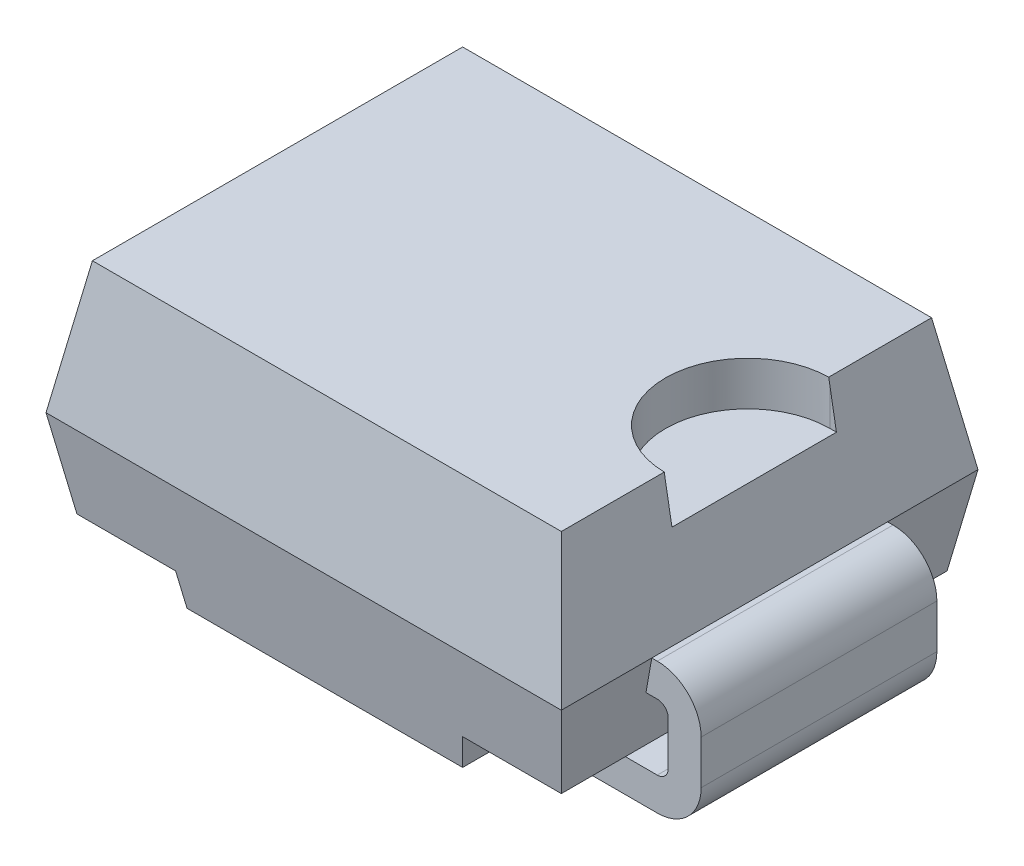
ISO-10303-21;
HEADER;
FILE_DESCRIPTION(('STEP AP214'),'2;1');
FILE_NAME('part.step','',(''),(''),'','','');
FILE_SCHEMA(('AUTOMOTIVE_DESIGN { 1 0 10303 214 1 1 1 1 }'));
ENDSEC;
DATA;
#1=APPLICATION_CONTEXT('core data for automotive mechanical design processes');
#2=APPLICATION_PROTOCOL_DEFINITION('international standard','automotive_design',2000,#1);
#3=PRODUCT_CONTEXT('',#1,'mechanical');
#4=PRODUCT('Part','Part','',(#3));
#5=PRODUCT_RELATED_PRODUCT_CATEGORY('part','',(#4));
#6=PRODUCT_DEFINITION_FORMATION('','',#4);
#7=PRODUCT_DEFINITION_CONTEXT('part definition',#1,'design');
#8=PRODUCT_DEFINITION('design','',#6,#7);
#9=PRODUCT_DEFINITION_SHAPE('','',#8);
#10=(LENGTH_UNIT() NAMED_UNIT(*) SI_UNIT(.MILLI.,.METRE.));
#11=(NAMED_UNIT(*) PLANE_ANGLE_UNIT() SI_UNIT($,.RADIAN.));
#12=(NAMED_UNIT(*) SI_UNIT($,.STERADIAN.) SOLID_ANGLE_UNIT());
#13=UNCERTAINTY_MEASURE_WITH_UNIT(LENGTH_MEASURE(1.E-05),#10,'distance_accuracy_value','');
#14=(GEOMETRIC_REPRESENTATION_CONTEXT(3) GLOBAL_UNCERTAINTY_ASSIGNED_CONTEXT((#13)) GLOBAL_UNIT_ASSIGNED_CONTEXT((#10,
#11,#12)) REPRESENTATION_CONTEXT('',''));
#15=CARTESIAN_POINT('',(0.,0.,0.));
#16=DIRECTION('',(0.,0.,1.));
#17=DIRECTION('',(1.,0.,0.));
#18=AXIS2_PLACEMENT_3D('',#15,#16,#17);
#19=CARTESIAN_POINT('',(-2.35,1.2,1.9));
#20=DIRECTION('',(0.984807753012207,0.173648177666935,0.));
#21=DIRECTION('',(-0.173648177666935,0.984807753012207,0.));
#22=AXIS2_PLACEMENT_3D('',#19,#20,#21);
#23=PLANE('',#22);
#24=DIRECTION('',(-0.17108786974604,0.970287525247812,-0.171087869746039));
#25=VECTOR('',#24,1.);
#26=CARTESIAN_POINT('',(-2.2387699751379,0.569183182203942,-1.7887699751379));
#27=LINE('',#26,#25);
#28=CARTESIAN_POINT('',(-2.20893841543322,0.4,-1.75893841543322));
#29=VERTEX_POINT('',#28);
#30=CARTESIAN_POINT('',(-2.35,1.2,-1.9));
#31=VERTEX_POINT('',#30);
#32=EDGE_CURVE('E330',#29,#31,#27,.T.);
#33=ORIENTED_EDGE('',*,*,#32,.F.);
#34=DIRECTION('',(0.,0.,-1.));
#35=VECTOR('',#34,1.);
#36=CARTESIAN_POINT('',(-2.20893841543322,0.4,1.9));
#37=LINE('',#36,#35);
#38=CARTESIAN_POINT('',(-2.20893841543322,0.4,1.75893841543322));
#39=VERTEX_POINT('',#38);
#40=EDGE_CURVE('E376',#39,#29,#37,.T.);
#41=ORIENTED_EDGE('',*,*,#40,.F.);
#42=DIRECTION('',(0.17108786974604,-0.970287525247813,-0.171087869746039));
#43=VECTOR('',#42,1.);
#44=CARTESIAN_POINT('',(-2.35,1.2,1.9));
#45=LINE('',#44,#43);
#46=CARTESIAN_POINT('',(-2.35,1.2,1.9));
#47=VERTEX_POINT('',#46);
#48=EDGE_CURVE('E347',#47,#39,#45,.T.);
#49=ORIENTED_EDGE('',*,*,#48,.F.);
#50=DIRECTION('',(0.,0.,-1.));
#51=VECTOR('',#50,1.);
#52=CARTESIAN_POINT('',(-2.35,1.2,1.9));
#53=LINE('',#52,#51);
#54=CARTESIAN_POINT('',(-2.35,1.2,1.075));
#55=VERTEX_POINT('',#54);
#56=EDGE_CURVE('E380',#47,#55,#53,.T.);
#57=ORIENTED_EDGE('',*,*,#56,.T.);
#58=DIRECTION('',(0.173648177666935,-0.984807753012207,0.));
#59=VECTOR('',#58,1.);
#60=CARTESIAN_POINT('',(-2.21469962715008,0.432673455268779,1.075));
#61=LINE('',#60,#59);
#62=CARTESIAN_POINT('',(-2.29710190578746,0.9,1.075));
#63=VERTEX_POINT('',#62);
#64=EDGE_CURVE('E390',#55,#63,#61,.T.);
#65=ORIENTED_EDGE('',*,*,#64,.T.);
#66=DIRECTION('',(0.,0.,-1.));
#67=VECTOR('',#66,1.);
#68=CARTESIAN_POINT('',(-2.29710190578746,0.9,1.075));
#69=LINE('',#68,#67);
#70=CARTESIAN_POINT('',(-2.29710190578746,0.9,-1.075));
#71=VERTEX_POINT('',#70);
#72=EDGE_CURVE('E388',#63,#71,#69,.T.);
#73=ORIENTED_EDGE('',*,*,#72,.T.);
#74=DIRECTION('',(0.173648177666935,-0.984807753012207,0.));
#75=VECTOR('',#74,1.);
#76=CARTESIAN_POINT('',(-2.21469962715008,0.432673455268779,-1.075));
#77=LINE('',#76,#75);
#78=CARTESIAN_POINT('',(-2.35,1.2,-1.075));
#79=VERTEX_POINT('',#78);
#80=EDGE_CURVE('E545',#79,#71,#77,.T.);
#81=ORIENTED_EDGE('',*,*,#80,.F.);
#82=EDGE_CURVE('E379',#79,#31,#53,.T.);
#83=ORIENTED_EDGE('',*,*,#82,.T.);
#84=EDGE_LOOP('',(#33,#41,#49,#57,#65,#73,#81,#83));
#85=FACE_BOUND('',#84,.T.);
#86=ADVANCED_FACE('F31',(#85),#23,.F.);
#87=CARTESIAN_POINT('',(2.35,1.2,1.9));
#88=DIRECTION('',(-0.984807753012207,0.173648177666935,0.));
#89=DIRECTION('',(-0.173648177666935,-0.984807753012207,0.));
#90=AXIS2_PLACEMENT_3D('',#87,#88,#89);
#91=PLANE('',#90);
#92=DIRECTION('',(-0.17108786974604,-0.970287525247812,0.171087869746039));
#93=VECTOR('',#92,1.);
#94=CARTESIAN_POINT('',(2.2387699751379,0.569183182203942,-1.7887699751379));
#95=LINE('',#94,#93);
#96=CARTESIAN_POINT('',(2.35,1.2,-1.9));
#97=VERTEX_POINT('',#96);
#98=CARTESIAN_POINT('',(2.20893841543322,0.4,-1.75893841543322));
#99=VERTEX_POINT('',#98);
#100=EDGE_CURVE('E328',#97,#99,#95,.T.);
#101=ORIENTED_EDGE('',*,*,#100,.F.);
#102=DIRECTION('',(0.,0.,-1.));
#103=VECTOR('',#102,1.);
#104=CARTESIAN_POINT('',(2.35,1.2,1.9));
#105=LINE('',#104,#103);
#106=CARTESIAN_POINT('',(2.35,1.2,-1.075));
#107=VERTEX_POINT('',#106);
#108=EDGE_CURVE('E356',#107,#97,#105,.T.);
#109=ORIENTED_EDGE('',*,*,#108,.F.);
#110=DIRECTION('',(0.173648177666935,0.984807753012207,0.));
#111=VECTOR('',#110,1.);
#112=CARTESIAN_POINT('',(2.06996191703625,-0.388174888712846,-1.075));
#113=LINE('',#112,#111);
#114=CARTESIAN_POINT('',(2.29710190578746,0.9,-1.075));
#115=VERTEX_POINT('',#114);
#116=EDGE_CURVE('E542',#115,#107,#113,.T.);
#117=ORIENTED_EDGE('',*,*,#116,.F.);
#118=DIRECTION('',(0.,0.,1.));
#119=VECTOR('',#118,1.);
#120=CARTESIAN_POINT('',(2.29710190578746,0.9,1.075));
#121=LINE('',#120,#119);
#122=CARTESIAN_POINT('',(2.29710190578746,0.9,1.075));
#123=VERTEX_POINT('',#122);
#124=EDGE_CURVE('E383',#115,#123,#121,.T.);
#125=ORIENTED_EDGE('',*,*,#124,.T.);
#126=DIRECTION('',(0.173648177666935,0.984807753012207,0.));
#127=VECTOR('',#126,1.);
#128=CARTESIAN_POINT('',(2.06996191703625,-0.388174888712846,1.075));
#129=LINE('',#128,#127);
#130=CARTESIAN_POINT('',(2.35,1.2,1.075));
#131=VERTEX_POINT('',#130);
#132=EDGE_CURVE('E386',#123,#131,#129,.T.);
#133=ORIENTED_EDGE('',*,*,#132,.T.);
#134=CARTESIAN_POINT('',(2.35,1.2,1.9));
#135=VERTEX_POINT('',#134);
#136=EDGE_CURVE('E357',#135,#131,#105,.T.);
#137=ORIENTED_EDGE('',*,*,#136,.F.);
#138=DIRECTION('',(0.17108786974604,0.970287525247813,0.171087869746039));
#139=VECTOR('',#138,1.);
#140=CARTESIAN_POINT('',(2.35,1.2,1.9));
#141=LINE('',#140,#139);
#142=CARTESIAN_POINT('',(2.20893841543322,0.4,1.75893841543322));
#143=VERTEX_POINT('',#142);
#144=EDGE_CURVE('E345',#143,#135,#141,.T.);
#145=ORIENTED_EDGE('',*,*,#144,.F.);
#146=DIRECTION('',(0.,0.,-1.));
#147=VECTOR('',#146,1.);
#148=CARTESIAN_POINT('',(2.20893841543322,0.4,1.9));
#149=LINE('',#148,#147);
#150=EDGE_CURVE('E360',#143,#99,#149,.T.);
#151=ORIENTED_EDGE('',*,*,#150,.T.);
#152=EDGE_LOOP('',(#101,#109,#117,#125,#133,#137,#145,#151));
#153=FACE_BOUND('',#152,.T.);
#154=ADVANCED_FACE('F641',(#153),#91,.F.);
#155=CARTESIAN_POINT('',(-2.13840762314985,2.4,1.9));
#156=DIRECTION('',(0.984807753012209,-0.173648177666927,0.));
#157=DIRECTION('',(0.173648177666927,0.984807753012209,0.));
#158=AXIS2_PLACEMENT_3D('',#155,#156,#157);
#159=PLANE('',#158);
#160=DIRECTION('',(-0.171087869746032,-0.970287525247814,0.17108786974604));
#161=VECTOR('',#160,1.);
#162=CARTESIAN_POINT('',(-2.14460115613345,2.36487472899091,1.69460115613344));
#163=LINE('',#162,#161);
#164=CARTESIAN_POINT('',(-2.13840762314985,2.4,1.68840762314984));
#165=VERTEX_POINT('',#164);
#166=EDGE_CURVE('E333',#165,#47,#163,.T.);
#167=ORIENTED_EDGE('',*,*,#166,.F.);
#168=DIRECTION('',(0.,0.,-1.));
#169=VECTOR('',#168,1.);
#170=CARTESIAN_POINT('',(-2.13840762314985,2.4,1.9));
#171=LINE('',#170,#169);
#172=CARTESIAN_POINT('',(-2.13840762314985,2.4,-1.68840762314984));
#173=VERTEX_POINT('',#172);
#174=EDGE_CURVE('E349',#165,#173,#171,.T.);
#175=ORIENTED_EDGE('',*,*,#174,.T.);
#176=DIRECTION('',(0.171087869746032,0.970287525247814,0.17108786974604));
#177=VECTOR('',#176,1.);
#178=CARTESIAN_POINT('',(-2.03337113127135,2.99569154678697,-1.58337113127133));
#179=LINE('',#178,#177);
#180=EDGE_CURVE('E316',#31,#173,#179,.T.);
#181=ORIENTED_EDGE('',*,*,#180,.F.);
#182=ORIENTED_EDGE('',*,*,#82,.F.);
#183=EDGE_CURVE('E384',#55,#79,#53,.T.);
#184=ORIENTED_EDGE('',*,*,#183,.F.);
#185=ORIENTED_EDGE('',*,*,#56,.F.);
#186=EDGE_LOOP('',(#167,#175,#181,#182,#184,#185));
#187=FACE_BOUND('',#186,.T.);
#188=ADVANCED_FACE('F567',(#187),#159,.F.);
#189=CARTESIAN_POINT('',(-2.20893841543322,0.4,1.9));
#190=DIRECTION('',(0.,1.,0.));
#191=DIRECTION('',(-1.,0.,0.));
#192=AXIS2_PLACEMENT_3D('',#189,#190,#191);
#193=PLANE('',#192);
#194=DIRECTION('',(-1.,0.,0.));
#195=VECTOR('',#194,1.);
#196=CARTESIAN_POINT('',(-2.20893841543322,0.4,-1.75893841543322));
#197=LINE('',#196,#195);
#198=CARTESIAN_POINT('',(-1.30893841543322,0.399999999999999,-1.75893841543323));
#199=VERTEX_POINT('',#198);
#200=EDGE_CURVE('E326',#199,#29,#197,.T.);
#201=ORIENTED_EDGE('',*,*,#200,.F.);
#202=DIRECTION('',(0.,0.,-1.));
#203=VECTOR('',#202,1.);
#204=CARTESIAN_POINT('',(-1.30893841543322,0.4,1.9));
#205=LINE('',#204,#203);
#206=CARTESIAN_POINT('',(-1.30893841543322,0.4,1.75893841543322));
#207=VERTEX_POINT('',#206);
#208=EDGE_CURVE('E373',#207,#199,#205,.T.);
#209=ORIENTED_EDGE('',*,*,#208,.F.);
#210=DIRECTION('',(1.,0.,0.));
#211=VECTOR('',#210,1.);
#212=CARTESIAN_POINT('',(-2.20893841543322,0.4,1.75893841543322));
#213=LINE('',#212,#211);
#214=EDGE_CURVE('E343',#39,#207,#213,.T.);
#215=ORIENTED_EDGE('',*,*,#214,.F.);
#216=ORIENTED_EDGE('',*,*,#40,.T.);
#217=EDGE_LOOP('',(#201,#209,#215,#216));
#218=FACE_BOUND('',#217,.T.);
#219=ADVANCED_FACE('F650',(#218),#193,.F.);
#220=CARTESIAN_POINT('',(-1.30893841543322,0.4,1.9));
#221=DIRECTION('',(0.984807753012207,0.173648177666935,0.));
#222=DIRECTION('',(-0.173648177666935,0.984807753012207,0.));
#223=AXIS2_PLACEMENT_3D('',#220,#221,#222);
#224=PLANE('',#223);
#225=DIRECTION('',(-0.17108786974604,0.970287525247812,-0.171087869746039));
#226=VECTOR('',#225,1.);
#227=CARTESIAN_POINT('',(-1.20183741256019,-0.207399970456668,-1.65183741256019));
#228=LINE('',#227,#226);
#229=CARTESIAN_POINT('',(-1.25684396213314,0.104557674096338,-1.70684396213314));
#230=VERTEX_POINT('',#229);
#231=EDGE_CURVE('E324',#230,#199,#228,.T.);
#232=ORIENTED_EDGE('',*,*,#231,.F.);
#233=DIRECTION('',(0.,0.,-1.));
#234=VECTOR('',#233,1.);
#235=CARTESIAN_POINT('',(-1.25684396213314,0.104557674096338,1.9));
#236=LINE('',#235,#234);
#237=CARTESIAN_POINT('',(-1.25684396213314,0.104557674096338,1.70684396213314));
#238=VERTEX_POINT('',#237);
#239=EDGE_CURVE('E370',#238,#230,#236,.T.);
#240=ORIENTED_EDGE('',*,*,#239,.F.);
#241=DIRECTION('',(0.17108786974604,-0.970287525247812,-0.171087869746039));
#242=VECTOR('',#241,1.);
#243=CARTESIAN_POINT('',(-1.31306743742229,0.42341684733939,1.76306743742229));
#244=LINE('',#243,#242);
#245=EDGE_CURVE('E341',#207,#238,#244,.T.);
#246=ORIENTED_EDGE('',*,*,#245,.F.);
#247=ORIENTED_EDGE('',*,*,#208,.T.);
#248=EDGE_LOOP('',(#232,#240,#246,#247));
#249=FACE_BOUND('',#248,.T.);
#250=ADVANCED_FACE('F718',(#249),#224,.F.);
#251=CARTESIAN_POINT('',(-1.25684396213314,0.104557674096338,1.9));
#252=DIRECTION('',(0.,1.,0.));
#253=DIRECTION('',(0.,0.,1.));
#254=AXIS2_PLACEMENT_3D('',#251,#252,#253);
#255=PLANE('',#254);
#256=DIRECTION('',(-1.,0.,0.));
#257=VECTOR('',#256,1.);
#258=CARTESIAN_POINT('',(-1.25684396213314,0.104557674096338,-1.70684396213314));
#259=LINE('',#258,#257);
#260=CARTESIAN_POINT('',(1.25684396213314,0.104557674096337,-1.70684396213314));
#261=VERTEX_POINT('',#260);
#262=EDGE_CURVE('E322',#261,#230,#259,.T.);
#263=ORIENTED_EDGE('',*,*,#262,.F.);
#264=DIRECTION('',(0.,0.,-1.));
#265=VECTOR('',#264,1.);
#266=CARTESIAN_POINT('',(1.25684396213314,0.104557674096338,1.9));
#267=LINE('',#266,#265);
#268=CARTESIAN_POINT('',(1.25684396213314,0.104557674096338,1.70684396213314));
#269=VERTEX_POINT('',#268);
#270=EDGE_CURVE('E367',#269,#261,#267,.T.);
#271=ORIENTED_EDGE('',*,*,#270,.F.);
#272=DIRECTION('',(1.,0.,0.));
#273=VECTOR('',#272,1.);
#274=CARTESIAN_POINT('',(-1.25684396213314,0.104557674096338,1.70684396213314));
#275=LINE('',#274,#273);
#276=EDGE_CURVE('E339',#238,#269,#275,.T.);
#277=ORIENTED_EDGE('',*,*,#276,.F.);
#278=ORIENTED_EDGE('',*,*,#239,.T.);
#279=EDGE_LOOP('',(#263,#271,#277,#278));
#280=FACE_BOUND('',#279,.T.);
#281=ADVANCED_FACE('F713',(#280),#255,.F.);
#282=CARTESIAN_POINT('',(1.30893841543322,0.4,1.9));
#283=DIRECTION('',(-0.984807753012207,0.173648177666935,0.));
#284=DIRECTION('',(-0.173648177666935,-0.984807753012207,0.));
#285=AXIS2_PLACEMENT_3D('',#282,#283,#284);
#286=PLANE('',#285);
#287=DIRECTION('',(-0.17108786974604,-0.970287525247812,0.171087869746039));
#288=VECTOR('',#287,1.);
#289=CARTESIAN_POINT('',(1.20183741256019,-0.207399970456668,-1.65183741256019));
#290=LINE('',#289,#288);
#291=CARTESIAN_POINT('',(1.30893841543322,0.4,-1.75893841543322));
#292=VERTEX_POINT('',#291);
#293=EDGE_CURVE('E320',#292,#261,#290,.T.);
#294=ORIENTED_EDGE('',*,*,#293,.F.);
#295=DIRECTION('',(0.,0.,-1.));
#296=VECTOR('',#295,1.);
#297=CARTESIAN_POINT('',(1.30893841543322,0.4,1.9));
#298=LINE('',#297,#296);
#299=CARTESIAN_POINT('',(1.30893841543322,0.4,1.75893841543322));
#300=VERTEX_POINT('',#299);
#301=EDGE_CURVE('E364',#300,#292,#298,.T.);
#302=ORIENTED_EDGE('',*,*,#301,.F.);
#303=DIRECTION('',(0.17108786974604,0.970287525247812,0.171087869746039));
#304=VECTOR('',#303,1.);
#305=CARTESIAN_POINT('',(1.31306743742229,0.42341684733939,1.76306743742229));
#306=LINE('',#305,#304);
#307=EDGE_CURVE('E337',#269,#300,#306,.T.);
#308=ORIENTED_EDGE('',*,*,#307,.F.);
#309=ORIENTED_EDGE('',*,*,#270,.T.);
#310=EDGE_LOOP('',(#294,#302,#308,#309));
#311=FACE_BOUND('',#310,.T.);
#312=ADVANCED_FACE('F708',(#311),#286,.F.);
#313=CARTESIAN_POINT('',(2.20893841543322,0.4,1.9));
#314=DIRECTION('',(0.,1.,0.));
#315=DIRECTION('',(-1.,0.,0.));
#316=AXIS2_PLACEMENT_3D('',#313,#314,#315);
#317=PLANE('',#316);
#318=DIRECTION('',(-1.,0.,0.));
#319=VECTOR('',#318,1.);
#320=CARTESIAN_POINT('',(2.20893841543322,0.4,-1.75893841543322));
#321=LINE('',#320,#319);
#322=EDGE_CURVE('E318',#99,#292,#321,.T.);
#323=ORIENTED_EDGE('',*,*,#322,.F.);
#324=ORIENTED_EDGE('',*,*,#150,.F.);
#325=DIRECTION('',(1.,0.,0.));
#326=VECTOR('',#325,1.);
#327=CARTESIAN_POINT('',(2.20893841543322,0.4,1.75893841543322));
#328=LINE('',#327,#326);
#329=EDGE_CURVE('E335',#300,#143,#328,.T.);
#330=ORIENTED_EDGE('',*,*,#329,.F.);
#331=ORIENTED_EDGE('',*,*,#301,.T.);
#332=EDGE_LOOP('',(#323,#324,#330,#331));
#333=FACE_BOUND('',#332,.T.);
#334=ADVANCED_FACE('F703',(#333),#317,.F.);
#335=CARTESIAN_POINT('',(2.13840762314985,2.4,1.9));
#336=DIRECTION('',(-0.984807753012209,-0.173648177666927,0.));
#337=DIRECTION('',(0.173648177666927,-0.984807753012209,0.));
#338=AXIS2_PLACEMENT_3D('',#335,#336,#337);
#339=PLANE('',#338);
#340=DIRECTION('',(-0.173648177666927,0.984807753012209,0.));
#341=VECTOR('',#340,1.);
#342=CARTESIAN_POINT('',(2.13840762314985,2.4,0.75));
#343=LINE('',#342,#341);
#344=CARTESIAN_POINT('',(2.20893841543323,2.,0.75));
#345=VERTEX_POINT('',#344);
#346=CARTESIAN_POINT('',(2.15,2.33425636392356,0.75));
#347=VERTEX_POINT('',#346);
#348=EDGE_CURVE('E12',#345,#347,#343,.T.);
#349=ORIENTED_EDGE('',*,*,#348,.T.);
#350=CARTESIAN_POINT('',(2.15,2.33425636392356,0.));
#351=DIRECTION('',(-0.984807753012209,-0.173648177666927,0.));
#352=DIRECTION('',(-0.173648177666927,0.984807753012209,0.));
#353=AXIS2_PLACEMENT_3D('',#350,#351,#352);
#354=ELLIPSE('',#353,4.31907786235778,0.75);
#355=CARTESIAN_POINT('',(2.13840762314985,2.4,0.749910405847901));
#356=VERTEX_POINT('',#355);
#357=EDGE_CURVE('E300',#347,#356,#354,.T.);
#358=ORIENTED_EDGE('',*,*,#357,.T.);
#359=DIRECTION('',(0.,0.,-1.));
#360=VECTOR('',#359,1.);
#361=CARTESIAN_POINT('',(2.13840762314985,2.4,1.9));
#362=LINE('',#361,#360);
#363=CARTESIAN_POINT('',(2.13840762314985,2.4,1.68840762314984));
#364=VERTEX_POINT('',#363);
#365=EDGE_CURVE('E353',#364,#356,#362,.T.);
#366=ORIENTED_EDGE('',*,*,#365,.F.);
#367=DIRECTION('',(-0.171087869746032,0.970287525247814,-0.17108786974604));
#368=VECTOR('',#367,1.);
#369=CARTESIAN_POINT('',(2.14460115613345,2.36487472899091,1.69460115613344));
#370=LINE('',#369,#368);
#371=EDGE_CURVE('E54',#135,#364,#370,.T.);
#372=ORIENTED_EDGE('',*,*,#371,.F.);
#373=ORIENTED_EDGE('',*,*,#136,.T.);
#374=EDGE_CURVE('E361',#131,#107,#105,.T.);
#375=ORIENTED_EDGE('',*,*,#374,.T.);
#376=ORIENTED_EDGE('',*,*,#108,.T.);
#377=DIRECTION('',(0.171087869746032,-0.970287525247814,-0.17108786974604));
#378=VECTOR('',#377,1.);
#379=CARTESIAN_POINT('',(2.03337113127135,2.99569154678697,-1.58337113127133));
#380=LINE('',#379,#378);
#381=CARTESIAN_POINT('',(2.13840762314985,2.4,-1.68840762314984));
#382=VERTEX_POINT('',#381);
#383=EDGE_CURVE('E306',#382,#97,#380,.T.);
#384=ORIENTED_EDGE('',*,*,#383,.F.);
#385=CARTESIAN_POINT('',(2.13840762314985,2.4,-0.749910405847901));
#386=VERTEX_POINT('',#385);
#387=EDGE_CURVE('E352',#386,#382,#362,.T.);
#388=ORIENTED_EDGE('',*,*,#387,.F.);
#389=CARTESIAN_POINT('',(2.15,2.33425636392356,-0.75));
#390=VERTEX_POINT('',#389);
#391=EDGE_CURVE('E46',#386,#390,#354,.T.);
#392=ORIENTED_EDGE('',*,*,#391,.T.);
#393=DIRECTION('',(0.173648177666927,-0.984807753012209,0.));
#394=VECTOR('',#393,1.);
#395=CARTESIAN_POINT('',(2.13840762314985,2.4,-0.75));
#396=LINE('',#395,#394);
#397=CARTESIAN_POINT('',(2.20893841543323,2.,-0.75));
#398=VERTEX_POINT('',#397);
#399=EDGE_CURVE('E39',#390,#398,#396,.T.);
#400=ORIENTED_EDGE('',*,*,#399,.T.);
#401=DIRECTION('',(0.,0.,1.));
#402=VECTOR('',#401,1.);
#403=CARTESIAN_POINT('',(2.20893841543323,2.,1.9));
#404=LINE('',#403,#402);
#405=EDGE_CURVE('E286',#398,#345,#404,.T.);
#406=ORIENTED_EDGE('',*,*,#405,.T.);
#407=EDGE_LOOP('',(#349,#358,#366,#372,#373,#375,#376,#384,#388,#392,#400,#406));
#408=FACE_BOUND('',#407,.T.);
#409=ADVANCED_FACE('F551',(#408),#339,.F.);
#410=CARTESIAN_POINT('',(2.13840762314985,2.4,1.9));
#411=DIRECTION('',(0.,-1.,0.));
#412=DIRECTION('',(0.,0.,-1.));
#413=AXIS2_PLACEMENT_3D('',#410,#411,#412);
#414=PLANE('',#413);
#415=ORIENTED_EDGE('',*,*,#365,.T.);
#416=CARTESIAN_POINT('',(2.15,2.4,0.));
#417=DIRECTION('',(0.,-1.,0.));
#418=DIRECTION('',(0.,0.,-1.));
#419=AXIS2_PLACEMENT_3D('',#416,#417,#418);
#420=CIRCLE('',#419,0.75);
#421=EDGE_CURVE('E548',#356,#386,#420,.T.);
#422=ORIENTED_EDGE('',*,*,#421,.T.);
#423=ORIENTED_EDGE('',*,*,#387,.T.);
#424=DIRECTION('',(1.,0.,0.));
#425=VECTOR('',#424,1.);
#426=CARTESIAN_POINT('',(-2.8,2.4,-1.68840762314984));
#427=LINE('',#426,#425);
#428=EDGE_CURVE('E309',#173,#382,#427,.T.);
#429=ORIENTED_EDGE('',*,*,#428,.F.);
#430=ORIENTED_EDGE('',*,*,#174,.F.);
#431=DIRECTION('',(1.,0.,0.));
#432=VECTOR('',#431,1.);
#433=CARTESIAN_POINT('',(-2.8,2.4,1.68840762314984));
#434=LINE('',#433,#432);
#435=EDGE_CURVE('E307',#165,#364,#434,.T.);
#436=ORIENTED_EDGE('',*,*,#435,.T.);
#437=EDGE_LOOP('',(#415,#422,#423,#429,#430,#436));
#438=FACE_BOUND('',#437,.T.);
#439=ADVANCED_FACE('F557',(#438),#414,.F.);
#440=CARTESIAN_POINT('',(-2.4,0.9,1.075));
#441=DIRECTION('',(0.,1.,0.));
#442=DIRECTION('',(0.,0.,1.));
#443=AXIS2_PLACEMENT_3D('',#440,#441,#442);
#444=PLANE('',#443);
#445=ORIENTED_EDGE('',*,*,#72,.F.);
#446=DIRECTION('',(1.,0.,0.));
#447=VECTOR('',#446,1.);
#448=CARTESIAN_POINT('',(-2.4,0.9,1.075));
#449=LINE('',#448,#447);
#450=CARTESIAN_POINT('',(-2.4,0.9,1.075));
#451=VERTEX_POINT('',#450);
#452=EDGE_CURVE('E406',#451,#63,#449,.T.);
#453=ORIENTED_EDGE('',*,*,#452,.F.);
#454=DIRECTION('',(0.,0.,-1.));
#455=VECTOR('',#454,1.);
#456=CARTESIAN_POINT('',(-2.4,0.9,1.075));
#457=LINE('',#456,#455);
#458=CARTESIAN_POINT('',(-2.4,0.9,-1.075));
#459=VERTEX_POINT('',#458);
#460=EDGE_CURVE('E527',#451,#459,#457,.T.);
#461=ORIENTED_EDGE('',*,*,#460,.T.);
#462=DIRECTION('',(1.,0.,0.));
#463=VECTOR('',#462,1.);
#464=CARTESIAN_POINT('',(-2.4,0.9,-1.075));
#465=LINE('',#464,#463);
#466=EDGE_CURVE('E451',#459,#71,#465,.T.);
#467=ORIENTED_EDGE('',*,*,#466,.T.);
#468=EDGE_LOOP('',(#445,#453,#461,#467));
#469=FACE_BOUND('',#468,.T.);
#470=ADVANCED_FACE('F601',(#469),#444,.F.);
#471=CARTESIAN_POINT('',(-2.4,1.2,1.075));
#472=DIRECTION('',(0.,-1.,0.));
#473=DIRECTION('',(0.,0.,-1.));
#474=AXIS2_PLACEMENT_3D('',#471,#472,#473);
#475=PLANE('',#474);
#476=ORIENTED_EDGE('',*,*,#183,.T.);
#477=DIRECTION('',(-1.,0.,0.));
#478=VECTOR('',#477,1.);
#479=CARTESIAN_POINT('',(-2.4,1.2,-1.075));
#480=LINE('',#479,#478);
#481=CARTESIAN_POINT('',(-2.4,1.2,-1.075));
#482=VERTEX_POINT('',#481);
#483=EDGE_CURVE('E472',#79,#482,#480,.T.);
#484=ORIENTED_EDGE('',*,*,#483,.T.);
#485=DIRECTION('',(0.,0.,-1.));
#486=VECTOR('',#485,1.);
#487=CARTESIAN_POINT('',(-2.4,1.2,1.075));
#488=LINE('',#487,#486);
#489=CARTESIAN_POINT('',(-2.4,1.2,1.075));
#490=VERTEX_POINT('',#489);
#491=EDGE_CURVE('E494',#490,#482,#488,.T.);
#492=ORIENTED_EDGE('',*,*,#491,.F.);
#493=DIRECTION('',(-1.,0.,0.));
#494=VECTOR('',#493,1.);
#495=CARTESIAN_POINT('',(-2.4,1.2,1.075));
#496=LINE('',#495,#494);
#497=EDGE_CURVE('E427',#55,#490,#496,.T.);
#498=ORIENTED_EDGE('',*,*,#497,.F.);
#499=EDGE_LOOP('',(#476,#484,#492,#498));
#500=FACE_BOUND('',#499,.T.);
#501=ADVANCED_FACE('F575',(#500),#475,.F.);
#502=CARTESIAN_POINT('',(-2.4,0.4,1.075));
#503=DIRECTION('',(0.,0.,-1.));
#504=DIRECTION('',(-1.,0.,0.));
#505=AXIS2_PLACEMENT_3D('',#502,#503,#504);
#506=PLANE('',#505);
#507=ORIENTED_EDGE('',*,*,#64,.F.);
#508=ORIENTED_EDGE('',*,*,#497,.T.);
#509=CARTESIAN_POINT('',(-2.4,0.8,1.075));
#510=DIRECTION('',(0.,0.,1.));
#511=DIRECTION('',(-1.,0.,0.));
#512=AXIS2_PLACEMENT_3D('',#509,#510,#511);
#513=CIRCLE('',#512,0.4);
#514=CARTESIAN_POINT('',(-2.8,0.8,1.075));
#515=VERTEX_POINT('',#514);
#516=EDGE_CURVE('E431',#490,#515,#513,.T.);
#517=ORIENTED_EDGE('',*,*,#516,.T.);
#518=DIRECTION('',(0.,-1.,0.));
#519=VECTOR('',#518,1.);
#520=CARTESIAN_POINT('',(-2.8,0.4,1.075));
#521=LINE('',#520,#519);
#522=CARTESIAN_POINT('',(-2.8,0.4,1.075));
#523=VERTEX_POINT('',#522);
#524=EDGE_CURVE('E433',#515,#523,#521,.T.);
#525=ORIENTED_EDGE('',*,*,#524,.T.);
#526=CARTESIAN_POINT('',(-2.4,0.4,1.075));
#527=DIRECTION('',(0.,0.,1.));
#528=DIRECTION('',(-1.,0.,0.));
#529=AXIS2_PLACEMENT_3D('',#526,#527,#528);
#530=CIRCLE('',#529,0.4);
#531=CARTESIAN_POINT('',(-2.4,0.,1.075));
#532=VERTEX_POINT('',#531);
#533=EDGE_CURVE('E435',#523,#532,#530,.T.);
#534=ORIENTED_EDGE('',*,*,#533,.T.);
#535=DIRECTION('',(1.,0.,0.));
#536=VECTOR('',#535,1.);
#537=CARTESIAN_POINT('',(-1.5,0.,1.075));
#538=LINE('',#537,#536);
#539=CARTESIAN_POINT('',(-1.5,0.,1.075));
#540=VERTEX_POINT('',#539);
#541=EDGE_CURVE('E437',#532,#540,#538,.T.);
#542=ORIENTED_EDGE('',*,*,#541,.T.);
#543=DIRECTION('',(0.,1.,0.));
#544=VECTOR('',#543,1.);
#545=CARTESIAN_POINT('',(-1.5,0.,1.075));
#546=LINE('',#545,#544);
#547=CARTESIAN_POINT('',(-1.5,0.3,1.075));
#548=VERTEX_POINT('',#547);
#549=EDGE_CURVE('E393',#540,#548,#546,.T.);
#550=ORIENTED_EDGE('',*,*,#549,.T.);
#551=DIRECTION('',(-1.,0.,0.));
#552=VECTOR('',#551,1.);
#553=CARTESIAN_POINT('',(-1.5,0.3,1.075));
#554=LINE('',#553,#552);
#555=CARTESIAN_POINT('',(-2.4,0.3,1.075));
#556=VERTEX_POINT('',#555);
#557=EDGE_CURVE('E396',#548,#556,#554,.T.);
#558=ORIENTED_EDGE('',*,*,#557,.T.);
#559=CARTESIAN_POINT('',(-2.4,0.4,1.075));
#560=DIRECTION('',(0.,0.,-1.));
#561=DIRECTION('',(-1.,0.,0.));
#562=AXIS2_PLACEMENT_3D('',#559,#560,#561);
#563=CIRCLE('',#562,0.1);
#564=CARTESIAN_POINT('',(-2.5,0.4,1.075));
#565=VERTEX_POINT('',#564);
#566=EDGE_CURVE('E399',#556,#565,#563,.T.);
#567=ORIENTED_EDGE('',*,*,#566,.T.);
#568=DIRECTION('',(0.,1.,0.));
#569=VECTOR('',#568,1.);
#570=CARTESIAN_POINT('',(-2.5,0.4,1.075));
#571=LINE('',#570,#569);
#572=CARTESIAN_POINT('',(-2.5,0.8,1.075));
#573=VERTEX_POINT('',#572);
#574=EDGE_CURVE('E401',#565,#573,#571,.T.);
#575=ORIENTED_EDGE('',*,*,#574,.T.);
#576=CARTESIAN_POINT('',(-2.4,0.8,1.075));
#577=DIRECTION('',(0.,0.,-1.));
#578=DIRECTION('',(-1.,0.,0.));
#579=AXIS2_PLACEMENT_3D('',#576,#577,#578);
#580=CIRCLE('',#579,0.0999999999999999);
#581=EDGE_CURVE('E403',#573,#451,#580,.T.);
#582=ORIENTED_EDGE('',*,*,#581,.T.);
#583=ORIENTED_EDGE('',*,*,#452,.T.);
#584=EDGE_LOOP('',(#507,#508,#517,#525,#534,#542,#550,#558,#567,#575,#582,#583));
#585=FACE_BOUND('',#584,.T.);
#586=ADVANCED_FACE('F595',(#585),#506,.F.);
#587=CARTESIAN_POINT('',(-2.4,0.4,-1.075));
#588=DIRECTION('',(0.,0.,-1.));
#589=DIRECTION('',(-1.,0.,0.));
#590=AXIS2_PLACEMENT_3D('',#587,#588,#589);
#591=PLANE('',#590);
#592=ORIENTED_EDGE('',*,*,#483,.F.);
#593=ORIENTED_EDGE('',*,*,#80,.T.);
#594=ORIENTED_EDGE('',*,*,#466,.F.);
#595=CARTESIAN_POINT('',(-2.4,0.8,-1.075));
#596=DIRECTION('',(0.,0.,-1.));
#597=DIRECTION('',(-1.,0.,0.));
#598=AXIS2_PLACEMENT_3D('',#595,#596,#597);
#599=CIRCLE('',#598,0.0999999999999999);
#600=CARTESIAN_POINT('',(-2.5,0.8,-1.075));
#601=VERTEX_POINT('',#600);
#602=EDGE_CURVE('E448',#601,#459,#599,.T.);
#603=ORIENTED_EDGE('',*,*,#602,.F.);
#604=DIRECTION('',(0.,1.,0.));
#605=VECTOR('',#604,1.);
#606=CARTESIAN_POINT('',(-2.5,0.4,-1.075));
#607=LINE('',#606,#605);
#608=CARTESIAN_POINT('',(-2.5,0.4,-1.075));
#609=VERTEX_POINT('',#608);
#610=EDGE_CURVE('E446',#609,#601,#607,.T.);
#611=ORIENTED_EDGE('',*,*,#610,.F.);
#612=CARTESIAN_POINT('',(-2.4,0.4,-1.075));
#613=DIRECTION('',(0.,0.,-1.));
#614=DIRECTION('',(-1.,0.,0.));
#615=AXIS2_PLACEMENT_3D('',#612,#613,#614);
#616=CIRCLE('',#615,0.1);
#617=CARTESIAN_POINT('',(-2.4,0.3,-1.075));
#618=VERTEX_POINT('',#617);
#619=EDGE_CURVE('E444',#618,#609,#616,.T.);
#620=ORIENTED_EDGE('',*,*,#619,.F.);
#621=DIRECTION('',(-1.,0.,0.));
#622=VECTOR('',#621,1.);
#623=CARTESIAN_POINT('',(-1.5,0.3,-1.075));
#624=LINE('',#623,#622);
#625=CARTESIAN_POINT('',(-1.5,0.3,-1.075));
#626=VERTEX_POINT('',#625);
#627=EDGE_CURVE('E442',#626,#618,#624,.T.);
#628=ORIENTED_EDGE('',*,*,#627,.F.);
#629=DIRECTION('',(0.,1.,0.));
#630=VECTOR('',#629,1.);
#631=CARTESIAN_POINT('',(-1.5,0.,-1.075));
#632=LINE('',#631,#630);
#633=CARTESIAN_POINT('',(-1.5,0.,-1.075));
#634=VERTEX_POINT('',#633);
#635=EDGE_CURVE('E392',#634,#626,#632,.T.);
#636=ORIENTED_EDGE('',*,*,#635,.F.);
#637=DIRECTION('',(1.,0.,0.));
#638=VECTOR('',#637,1.);
#639=CARTESIAN_POINT('',(-1.5,0.,-1.075));
#640=LINE('',#639,#638);
#641=CARTESIAN_POINT('',(-2.4,0.,-1.075));
#642=VERTEX_POINT('',#641);
#643=EDGE_CURVE('E397',#642,#634,#640,.T.);
#644=ORIENTED_EDGE('',*,*,#643,.F.);
#645=CARTESIAN_POINT('',(-2.4,0.4,-1.075));
#646=DIRECTION('',(0.,0.,1.));
#647=DIRECTION('',(-1.,0.,0.));
#648=AXIS2_PLACEMENT_3D('',#645,#646,#647);
#649=CIRCLE('',#648,0.4);
#650=CARTESIAN_POINT('',(-2.8,0.4,-1.075));
#651=VERTEX_POINT('',#650);
#652=EDGE_CURVE('E480',#651,#642,#649,.T.);
#653=ORIENTED_EDGE('',*,*,#652,.F.);
#654=DIRECTION('',(0.,-1.,0.));
#655=VECTOR('',#654,1.);
#656=CARTESIAN_POINT('',(-2.8,0.4,-1.075));
#657=LINE('',#656,#655);
#658=CARTESIAN_POINT('',(-2.8,0.8,-1.075));
#659=VERTEX_POINT('',#658);
#660=EDGE_CURVE('E478',#659,#651,#657,.T.);
#661=ORIENTED_EDGE('',*,*,#660,.F.);
#662=CARTESIAN_POINT('',(-2.4,0.8,-1.075));
#663=DIRECTION('',(0.,0.,1.));
#664=DIRECTION('',(-1.,0.,0.));
#665=AXIS2_PLACEMENT_3D('',#662,#663,#664);
#666=CIRCLE('',#665,0.4);
#667=EDGE_CURVE('E476',#482,#659,#666,.T.);
#668=ORIENTED_EDGE('',*,*,#667,.F.);
#669=EDGE_LOOP('',(#592,#593,#594,#603,#611,#620,#628,#636,#644,#653,#661,#668));
#670=FACE_BOUND('',#669,.T.);
#671=ADVANCED_FACE('F580',(#670),#591,.T.);
#672=CARTESIAN_POINT('',(-1.5,0.,1.075));
#673=DIRECTION('',(-1.,0.,0.));
#674=DIRECTION('',(0.,0.,1.));
#675=AXIS2_PLACEMENT_3D('',#672,#673,#674);
#676=PLANE('',#675);
#677=ORIENTED_EDGE('',*,*,#635,.T.);
#678=DIRECTION('',(0.,0.,-1.));
#679=VECTOR('',#678,1.);
#680=CARTESIAN_POINT('',(-1.5,0.3,1.075));
#681=LINE('',#680,#679);
#682=EDGE_CURVE('E539',#548,#626,#681,.T.);
#683=ORIENTED_EDGE('',*,*,#682,.F.);
#684=ORIENTED_EDGE('',*,*,#549,.F.);
#685=DIRECTION('',(0.,0.,-1.));
#686=VECTOR('',#685,1.);
#687=CARTESIAN_POINT('',(-1.5,0.,1.075));
#688=LINE('',#687,#686);
#689=EDGE_CURVE('E439',#540,#634,#688,.T.);
#690=ORIENTED_EDGE('',*,*,#689,.T.);
#691=EDGE_LOOP('',(#677,#683,#684,#690));
#692=FACE_BOUND('',#691,.T.);
#693=ADVANCED_FACE('F33',(#692),#676,.F.);
#694=CARTESIAN_POINT('',(-1.5,0.3,1.075));
#695=DIRECTION('',(0.,-1.,0.));
#696=DIRECTION('',(1.,0.,0.));
#697=AXIS2_PLACEMENT_3D('',#694,#695,#696);
#698=PLANE('',#697);
#699=ORIENTED_EDGE('',*,*,#627,.T.);
#700=DIRECTION('',(0.,0.,-1.));
#701=VECTOR('',#700,1.);
#702=CARTESIAN_POINT('',(-2.4,0.3,1.075));
#703=LINE('',#702,#701);
#704=EDGE_CURVE('E536',#556,#618,#703,.T.);
#705=ORIENTED_EDGE('',*,*,#704,.F.);
#706=ORIENTED_EDGE('',*,*,#557,.F.);
#707=ORIENTED_EDGE('',*,*,#682,.T.);
#708=EDGE_LOOP('',(#699,#705,#706,#707));
#709=FACE_BOUND('',#708,.T.);
#710=ADVANCED_FACE('F622',(#709),#698,.F.);
#711=CARTESIAN_POINT('',(-2.4,0.4,1.075));
#712=DIRECTION('',(0.,0.,-1.));
#713=DIRECTION('',(-1.,0.,0.));
#714=AXIS2_PLACEMENT_3D('',#711,#712,#713);
#715=CYLINDRICAL_SURFACE('',#714,0.1);
#716=ORIENTED_EDGE('',*,*,#619,.T.);
#717=DIRECTION('',(0.,0.,-1.));
#718=VECTOR('',#717,1.);
#719=CARTESIAN_POINT('',(-2.5,0.4,1.075));
#720=LINE('',#719,#718);
#721=EDGE_CURVE('E533',#565,#609,#720,.T.);
#722=ORIENTED_EDGE('',*,*,#721,.F.);
#723=ORIENTED_EDGE('',*,*,#566,.F.);
#724=ORIENTED_EDGE('',*,*,#704,.T.);
#725=EDGE_LOOP('',(#716,#722,#723,#724));
#726=FACE_BOUND('',#725,.T.);
#727=ADVANCED_FACE('F616',(#726),#715,.F.);
#728=CARTESIAN_POINT('',(-2.5,0.4,1.075));
#729=DIRECTION('',(-1.,0.,0.));
#730=DIRECTION('',(0.,0.,1.));
#731=AXIS2_PLACEMENT_3D('',#728,#729,#730);
#732=PLANE('',#731);
#733=ORIENTED_EDGE('',*,*,#610,.T.);
#734=DIRECTION('',(0.,0.,-1.));
#735=VECTOR('',#734,1.);
#736=CARTESIAN_POINT('',(-2.5,0.8,1.075));
#737=LINE('',#736,#735);
#738=EDGE_CURVE('E530',#573,#601,#737,.T.);
#739=ORIENTED_EDGE('',*,*,#738,.F.);
#740=ORIENTED_EDGE('',*,*,#574,.F.);
#741=ORIENTED_EDGE('',*,*,#721,.T.);
#742=EDGE_LOOP('',(#733,#739,#740,#741));
#743=FACE_BOUND('',#742,.T.);
#744=ADVANCED_FACE('F612',(#743),#732,.F.);
#745=CARTESIAN_POINT('',(-2.4,0.8,1.075));
#746=DIRECTION('',(0.,0.,-1.));
#747=DIRECTION('',(-1.,0.,0.));
#748=AXIS2_PLACEMENT_3D('',#745,#746,#747);
#749=CYLINDRICAL_SURFACE('',#748,0.0999999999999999);
#750=ORIENTED_EDGE('',*,*,#602,.T.);
#751=ORIENTED_EDGE('',*,*,#460,.F.);
#752=ORIENTED_EDGE('',*,*,#581,.F.);
#753=ORIENTED_EDGE('',*,*,#738,.T.);
#754=EDGE_LOOP('',(#750,#751,#752,#753));
#755=FACE_BOUND('',#754,.T.);
#756=ADVANCED_FACE('F607',(#755),#749,.F.);
#757=CARTESIAN_POINT('',(-2.4,0.8,1.075));
#758=DIRECTION('',(0.,0.,-1.));
#759=DIRECTION('',(-1.,0.,0.));
#760=AXIS2_PLACEMENT_3D('',#757,#758,#759);
#761=CYLINDRICAL_SURFACE('',#760,0.4);
#762=ORIENTED_EDGE('',*,*,#667,.T.);
#763=DIRECTION('',(0.,0.,-1.));
#764=VECTOR('',#763,1.);
#765=CARTESIAN_POINT('',(-2.8,0.8,1.075));
#766=LINE('',#765,#764);
#767=EDGE_CURVE('E491',#515,#659,#766,.T.);
#768=ORIENTED_EDGE('',*,*,#767,.F.);
#769=ORIENTED_EDGE('',*,*,#516,.F.);
#770=ORIENTED_EDGE('',*,*,#491,.T.);
#771=EDGE_LOOP('',(#762,#768,#769,#770));
#772=FACE_BOUND('',#771,.T.);
#773=ADVANCED_FACE('F586',(#772),#761,.T.);
#774=CARTESIAN_POINT('',(-2.8,0.4,1.075));
#775=DIRECTION('',(1.,0.,0.));
#776=DIRECTION('',(0.,1.,0.));
#777=AXIS2_PLACEMENT_3D('',#774,#775,#776);
#778=PLANE('',#777);
#779=ORIENTED_EDGE('',*,*,#660,.T.);
#780=DIRECTION('',(0.,0.,-1.));
#781=VECTOR('',#780,1.);
#782=CARTESIAN_POINT('',(-2.8,0.4,1.075));
#783=LINE('',#782,#781);
#784=EDGE_CURVE('E488',#523,#651,#783,.T.);
#785=ORIENTED_EDGE('',*,*,#784,.F.);
#786=ORIENTED_EDGE('',*,*,#524,.F.);
#787=ORIENTED_EDGE('',*,*,#767,.T.);
#788=EDGE_LOOP('',(#779,#785,#786,#787));
#789=FACE_BOUND('',#788,.T.);
#790=ADVANCED_FACE('F590',(#789),#778,.F.);
#791=CARTESIAN_POINT('',(-2.4,0.4,1.075));
#792=DIRECTION('',(0.,0.,-1.));
#793=DIRECTION('',(-1.,0.,0.));
#794=AXIS2_PLACEMENT_3D('',#791,#792,#793);
#795=CYLINDRICAL_SURFACE('',#794,0.4);
#796=ORIENTED_EDGE('',*,*,#652,.T.);
#797=DIRECTION('',(0.,0.,-1.));
#798=VECTOR('',#797,1.);
#799=CARTESIAN_POINT('',(-2.4,0.,1.075));
#800=LINE('',#799,#798);
#801=EDGE_CURVE('E485',#532,#642,#800,.T.);
#802=ORIENTED_EDGE('',*,*,#801,.F.);
#803=ORIENTED_EDGE('',*,*,#533,.F.);
#804=ORIENTED_EDGE('',*,*,#784,.T.);
#805=EDGE_LOOP('',(#796,#802,#803,#804));
#806=FACE_BOUND('',#805,.T.);
#807=ADVANCED_FACE('F630',(#806),#795,.T.);
#808=CARTESIAN_POINT('',(-1.5,0.,1.075));
#809=DIRECTION('',(0.,1.,0.));
#810=DIRECTION('',(-1.,0.,0.));
#811=AXIS2_PLACEMENT_3D('',#808,#809,#810);
#812=PLANE('',#811);
#813=ORIENTED_EDGE('',*,*,#643,.T.);
#814=ORIENTED_EDGE('',*,*,#689,.F.);
#815=ORIENTED_EDGE('',*,*,#541,.F.);
#816=ORIENTED_EDGE('',*,*,#801,.T.);
#817=EDGE_LOOP('',(#813,#814,#815,#816));
#818=FACE_BOUND('',#817,.T.);
#819=ADVANCED_FACE('F628',(#818),#812,.F.);
#820=CARTESIAN_POINT('',(2.4,0.8,1.075));
#821=DIRECTION('',(0.,0.,-1.));
#822=DIRECTION('',(-1.,0.,0.));
#823=AXIS2_PLACEMENT_3D('',#820,#821,#822);
#824=CYLINDRICAL_SURFACE('',#823,0.0999999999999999);
#825=CARTESIAN_POINT('',(2.4,0.8,-1.075));
#826=DIRECTION('',(0.,0.,-1.));
#827=DIRECTION('',(1.,0.,0.));
#828=AXIS2_PLACEMENT_3D('',#825,#826,#827);
#829=CIRCLE('',#828,0.0999999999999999);
#830=CARTESIAN_POINT('',(2.4,0.9,-1.075));
#831=VERTEX_POINT('',#830);
#832=CARTESIAN_POINT('',(2.5,0.8,-1.075));
#833=VERTEX_POINT('',#832);
#834=EDGE_CURVE('E454',#831,#833,#829,.T.);
#835=ORIENTED_EDGE('',*,*,#834,.T.);
#836=DIRECTION('',(0.,0.,-1.));
#837=VECTOR('',#836,1.);
#838=CARTESIAN_POINT('',(2.5,0.8,1.075));
#839=LINE('',#838,#837);
#840=CARTESIAN_POINT('',(2.5,0.8,1.075));
#841=VERTEX_POINT('',#840);
#842=EDGE_CURVE('E521',#841,#833,#839,.T.);
#843=ORIENTED_EDGE('',*,*,#842,.F.);
#844=CARTESIAN_POINT('',(2.4,0.8,1.075));
#845=DIRECTION('',(0.,0.,-1.));
#846=DIRECTION('',(1.,0.,0.));
#847=AXIS2_PLACEMENT_3D('',#844,#845,#846);
#848=CIRCLE('',#847,0.0999999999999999);
#849=CARTESIAN_POINT('',(2.4,0.9,1.075));
#850=VERTEX_POINT('',#849);
#851=EDGE_CURVE('E409',#850,#841,#848,.T.);
#852=ORIENTED_EDGE('',*,*,#851,.F.);
#853=DIRECTION('',(0.,0.,-1.));
#854=VECTOR('',#853,1.);
#855=CARTESIAN_POINT('',(2.4,0.9,1.075));
#856=LINE('',#855,#854);
#857=EDGE_CURVE('E524',#850,#831,#856,.T.);
#858=ORIENTED_EDGE('',*,*,#857,.T.);
#859=EDGE_LOOP('',(#835,#843,#852,#858));
#860=FACE_BOUND('',#859,.T.);
#861=ADVANCED_FACE('F637',(#860),#824,.F.);
#862=CARTESIAN_POINT('',(2.5,0.4,1.075));
#863=DIRECTION('',(1.,0.,0.));
#864=DIRECTION('',(0.,0.,-1.));
#865=AXIS2_PLACEMENT_3D('',#862,#863,#864);
#866=PLANE('',#865);
#867=DIRECTION('',(0.,-1.,0.));
#868=VECTOR('',#867,1.);
#869=CARTESIAN_POINT('',(2.5,0.4,-1.075));
#870=LINE('',#869,#868);
#871=CARTESIAN_POINT('',(2.5,0.4,-1.075));
#872=VERTEX_POINT('',#871);
#873=EDGE_CURVE('E456',#833,#872,#870,.T.);
#874=ORIENTED_EDGE('',*,*,#873,.T.);
#875=DIRECTION('',(0.,0.,-1.));
#876=VECTOR('',#875,1.);
#877=CARTESIAN_POINT('',(2.5,0.4,1.075));
#878=LINE('',#877,#876);
#879=CARTESIAN_POINT('',(2.5,0.4,1.075));
#880=VERTEX_POINT('',#879);
#881=EDGE_CURVE('E518',#880,#872,#878,.T.);
#882=ORIENTED_EDGE('',*,*,#881,.F.);
#883=DIRECTION('',(0.,-1.,0.));
#884=VECTOR('',#883,1.);
#885=CARTESIAN_POINT('',(2.5,0.4,1.075));
#886=LINE('',#885,#884);
#887=EDGE_CURVE('E411',#841,#880,#886,.T.);
#888=ORIENTED_EDGE('',*,*,#887,.F.);
#889=ORIENTED_EDGE('',*,*,#842,.T.);
#890=EDGE_LOOP('',(#874,#882,#888,#889));
#891=FACE_BOUND('',#890,.T.);
#892=ADVANCED_FACE('F917',(#891),#866,.F.);
#893=CARTESIAN_POINT('',(2.4,0.4,1.075));
#894=DIRECTION('',(0.,0.,-1.));
#895=DIRECTION('',(-1.,0.,0.));
#896=AXIS2_PLACEMENT_3D('',#893,#894,#895);
#897=CYLINDRICAL_SURFACE('',#896,0.1);
#898=CARTESIAN_POINT('',(2.4,0.4,-1.075));
#899=DIRECTION('',(0.,0.,-1.));
#900=DIRECTION('',(1.,0.,0.));
#901=AXIS2_PLACEMENT_3D('',#898,#899,#900);
#902=CIRCLE('',#901,0.1);
#903=CARTESIAN_POINT('',(2.4,0.299999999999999,-1.075));
#904=VERTEX_POINT('',#903);
#905=EDGE_CURVE('E458',#872,#904,#902,.T.);
#906=ORIENTED_EDGE('',*,*,#905,.T.);
#907=DIRECTION('',(0.,0.,-1.));
#908=VECTOR('',#907,1.);
#909=CARTESIAN_POINT('',(2.4,0.299999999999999,1.075));
#910=LINE('',#909,#908);
#911=CARTESIAN_POINT('',(2.4,0.299999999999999,1.075));
#912=VERTEX_POINT('',#911);
#913=EDGE_CURVE('E515',#912,#904,#910,.T.);
#914=ORIENTED_EDGE('',*,*,#913,.F.);
#915=CARTESIAN_POINT('',(2.4,0.4,1.075));
#916=DIRECTION('',(0.,0.,-1.));
#917=DIRECTION('',(1.,0.,0.));
#918=AXIS2_PLACEMENT_3D('',#915,#916,#917);
#919=CIRCLE('',#918,0.1);
#920=EDGE_CURVE('E413',#880,#912,#919,.T.);
#921=ORIENTED_EDGE('',*,*,#920,.F.);
#922=ORIENTED_EDGE('',*,*,#881,.T.);
#923=EDGE_LOOP('',(#906,#914,#921,#922));
#924=FACE_BOUND('',#923,.T.);
#925=ADVANCED_FACE('F907',(#924),#897,.F.);
#926=CARTESIAN_POINT('',(1.5,0.3,1.075));
#927=DIRECTION('',(0.,-1.,0.));
#928=DIRECTION('',(1.,0.,0.));
#929=AXIS2_PLACEMENT_3D('',#926,#927,#928);
#930=PLANE('',#929);
#931=DIRECTION('',(-1.,0.,0.));
#932=VECTOR('',#931,1.);
#933=CARTESIAN_POINT('',(1.5,0.3,-1.075));
#934=LINE('',#933,#932);
#935=CARTESIAN_POINT('',(1.5,0.3,-1.075));
#936=VERTEX_POINT('',#935);
#937=EDGE_CURVE('E460',#904,#936,#934,.T.);
#938=ORIENTED_EDGE('',*,*,#937,.T.);
#939=DIRECTION('',(0.,0.,-1.));
#940=VECTOR('',#939,1.);
#941=CARTESIAN_POINT('',(1.5,0.3,1.075));
#942=LINE('',#941,#940);
#943=CARTESIAN_POINT('',(1.5,0.3,1.075));
#944=VERTEX_POINT('',#943);
#945=EDGE_CURVE('E512',#944,#936,#942,.T.);
#946=ORIENTED_EDGE('',*,*,#945,.F.);
#947=DIRECTION('',(-1.,0.,0.));
#948=VECTOR('',#947,1.);
#949=CARTESIAN_POINT('',(1.5,0.3,1.075));
#950=LINE('',#949,#948);
#951=EDGE_CURVE('E415',#912,#944,#950,.T.);
#952=ORIENTED_EDGE('',*,*,#951,.F.);
#953=ORIENTED_EDGE('',*,*,#913,.T.);
#954=EDGE_LOOP('',(#938,#946,#952,#953));
#955=FACE_BOUND('',#954,.T.);
#956=ADVANCED_FACE('F897',(#955),#930,.F.);
#957=CARTESIAN_POINT('',(1.5,0.,1.075));
#958=DIRECTION('',(1.,0.,0.));
#959=DIRECTION('',(0.,0.,-1.));
#960=AXIS2_PLACEMENT_3D('',#957,#958,#959);
#961=PLANE('',#960);
#962=DIRECTION('',(0.,-1.,0.));
#963=VECTOR('',#962,1.);
#964=CARTESIAN_POINT('',(1.5,0.,-1.075));
#965=LINE('',#964,#963);
#966=CARTESIAN_POINT('',(1.5,0.,-1.075));
#967=VERTEX_POINT('',#966);
#968=EDGE_CURVE('E462',#936,#967,#965,.T.);
#969=ORIENTED_EDGE('',*,*,#968,.T.);
#970=DIRECTION('',(0.,0.,-1.));
#971=VECTOR('',#970,1.);
#972=CARTESIAN_POINT('',(1.5,0.,1.075));
#973=LINE('',#972,#971);
#974=CARTESIAN_POINT('',(1.5,0.,1.075));
#975=VERTEX_POINT('',#974);
#976=EDGE_CURVE('E509',#975,#967,#973,.T.);
#977=ORIENTED_EDGE('',*,*,#976,.F.);
#978=DIRECTION('',(0.,-1.,0.));
#979=VECTOR('',#978,1.);
#980=CARTESIAN_POINT('',(1.5,0.,1.075));
#981=LINE('',#980,#979);
#982=EDGE_CURVE('E417',#944,#975,#981,.T.);
#983=ORIENTED_EDGE('',*,*,#982,.F.);
#984=ORIENTED_EDGE('',*,*,#945,.T.);
#985=EDGE_LOOP('',(#969,#977,#983,#984));
#986=FACE_BOUND('',#985,.T.);
#987=ADVANCED_FACE('F887',(#986),#961,.F.);
#988=CARTESIAN_POINT('',(1.5,0.,1.075));
#989=DIRECTION('',(0.,1.,0.));
#990=DIRECTION('',(-1.,0.,0.));
#991=AXIS2_PLACEMENT_3D('',#988,#989,#990);
#992=PLANE('',#991);
#993=DIRECTION('',(1.,0.,0.));
#994=VECTOR('',#993,1.);
#995=CARTESIAN_POINT('',(1.5,0.,-1.075));
#996=LINE('',#995,#994);
#997=CARTESIAN_POINT('',(2.4,0.,-1.075));
#998=VERTEX_POINT('',#997);
#999=EDGE_CURVE('E464',#967,#998,#996,.T.);
#1000=ORIENTED_EDGE('',*,*,#999,.T.);
#1001=DIRECTION('',(0.,0.,-1.));
#1002=VECTOR('',#1001,1.);
#1003=CARTESIAN_POINT('',(2.4,0.,1.075));
#1004=LINE('',#1003,#1002);
#1005=CARTESIAN_POINT('',(2.4,0.,1.075));
#1006=VERTEX_POINT('',#1005);
#1007=EDGE_CURVE('E506',#1006,#998,#1004,.T.);
#1008=ORIENTED_EDGE('',*,*,#1007,.F.);
#1009=DIRECTION('',(1.,0.,0.));
#1010=VECTOR('',#1009,1.);
#1011=CARTESIAN_POINT('',(1.5,0.,1.075));
#1012=LINE('',#1011,#1010);
#1013=EDGE_CURVE('E419',#975,#1006,#1012,.T.);
#1014=ORIENTED_EDGE('',*,*,#1013,.F.);
#1015=ORIENTED_EDGE('',*,*,#976,.T.);
#1016=EDGE_LOOP('',(#1000,#1008,#1014,#1015));
#1017=FACE_BOUND('',#1016,.T.);
#1018=ADVANCED_FACE('F877',(#1017),#992,.F.);
#1019=CARTESIAN_POINT('',(2.4,0.4,1.075));
#1020=DIRECTION('',(0.,0.,-1.));
#1021=DIRECTION('',(-1.,0.,0.));
#1022=AXIS2_PLACEMENT_3D('',#1019,#1020,#1021);
#1023=CYLINDRICAL_SURFACE('',#1022,0.4);
#1024=CARTESIAN_POINT('',(2.4,0.4,-1.075));
#1025=DIRECTION('',(0.,0.,1.));
#1026=DIRECTION('',(1.,0.,0.));
#1027=AXIS2_PLACEMENT_3D('',#1024,#1025,#1026);
#1028=CIRCLE('',#1027,0.4);
#1029=CARTESIAN_POINT('',(2.8,0.4,-1.075));
#1030=VERTEX_POINT('',#1029);
#1031=EDGE_CURVE('E466',#998,#1030,#1028,.T.);
#1032=ORIENTED_EDGE('',*,*,#1031,.T.);
#1033=DIRECTION('',(0.,0.,-1.));
#1034=VECTOR('',#1033,1.);
#1035=CARTESIAN_POINT('',(2.8,0.4,1.075));
#1036=LINE('',#1035,#1034);
#1037=CARTESIAN_POINT('',(2.8,0.4,1.075));
#1038=VERTEX_POINT('',#1037);
#1039=EDGE_CURVE('E503',#1038,#1030,#1036,.T.);
#1040=ORIENTED_EDGE('',*,*,#1039,.F.);
#1041=CARTESIAN_POINT('',(2.4,0.4,1.075));
#1042=DIRECTION('',(0.,0.,1.));
#1043=DIRECTION('',(1.,0.,0.));
#1044=AXIS2_PLACEMENT_3D('',#1041,#1042,#1043);
#1045=CIRCLE('',#1044,0.4);
#1046=EDGE_CURVE('E421',#1006,#1038,#1045,.T.);
#1047=ORIENTED_EDGE('',*,*,#1046,.F.);
#1048=ORIENTED_EDGE('',*,*,#1007,.T.);
#1049=EDGE_LOOP('',(#1032,#1040,#1047,#1048));
#1050=FACE_BOUND('',#1049,.T.);
#1051=ADVANCED_FACE('F867',(#1050),#1023,.T.);
#1052=CARTESIAN_POINT('',(2.8,0.4,1.075));
#1053=DIRECTION('',(-1.,0.,0.));
#1054=DIRECTION('',(0.,0.,1.));
#1055=AXIS2_PLACEMENT_3D('',#1052,#1053,#1054);
#1056=PLANE('',#1055);
#1057=DIRECTION('',(0.,1.,0.));
#1058=VECTOR('',#1057,1.);
#1059=CARTESIAN_POINT('',(2.8,0.4,-1.075));
#1060=LINE('',#1059,#1058);
#1061=CARTESIAN_POINT('',(2.8,0.8,-1.075));
#1062=VERTEX_POINT('',#1061);
#1063=EDGE_CURVE('E468',#1030,#1062,#1060,.T.);
#1064=ORIENTED_EDGE('',*,*,#1063,.T.);
#1065=DIRECTION('',(0.,0.,-1.));
#1066=VECTOR('',#1065,1.);
#1067=CARTESIAN_POINT('',(2.8,0.8,1.075));
#1068=LINE('',#1067,#1066);
#1069=CARTESIAN_POINT('',(2.8,0.8,1.075));
#1070=VERTEX_POINT('',#1069);
#1071=EDGE_CURVE('E500',#1070,#1062,#1068,.T.);
#1072=ORIENTED_EDGE('',*,*,#1071,.F.);
#1073=DIRECTION('',(0.,1.,0.));
#1074=VECTOR('',#1073,1.);
#1075=CARTESIAN_POINT('',(2.8,0.4,1.075));
#1076=LINE('',#1075,#1074);
#1077=EDGE_CURVE('E423',#1038,#1070,#1076,.T.);
#1078=ORIENTED_EDGE('',*,*,#1077,.F.);
#1079=ORIENTED_EDGE('',*,*,#1039,.T.);
#1080=EDGE_LOOP('',(#1064,#1072,#1078,#1079));
#1081=FACE_BOUND('',#1080,.T.);
#1082=ADVANCED_FACE('F671',(#1081),#1056,.F.);
#1083=CARTESIAN_POINT('',(2.4,0.8,1.075));
#1084=DIRECTION('',(0.,0.,-1.));
#1085=DIRECTION('',(-1.,0.,0.));
#1086=AXIS2_PLACEMENT_3D('',#1083,#1084,#1085);
#1087=CYLINDRICAL_SURFACE('',#1086,0.4);
#1088=CARTESIAN_POINT('',(2.4,0.8,-1.075));
#1089=DIRECTION('',(0.,0.,1.));
#1090=DIRECTION('',(1.,0.,0.));
#1091=AXIS2_PLACEMENT_3D('',#1088,#1089,#1090);
#1092=CIRCLE('',#1091,0.4);
#1093=CARTESIAN_POINT('',(2.4,1.2,-1.075));
#1094=VERTEX_POINT('',#1093);
#1095=EDGE_CURVE('E470',#1062,#1094,#1092,.T.);
#1096=ORIENTED_EDGE('',*,*,#1095,.T.);
#1097=DIRECTION('',(0.,0.,-1.));
#1098=VECTOR('',#1097,1.);
#1099=CARTESIAN_POINT('',(2.4,1.2,1.075));
#1100=LINE('',#1099,#1098);
#1101=CARTESIAN_POINT('',(2.4,1.2,1.075));
#1102=VERTEX_POINT('',#1101);
#1103=EDGE_CURVE('E497',#1102,#1094,#1100,.T.);
#1104=ORIENTED_EDGE('',*,*,#1103,.F.);
#1105=CARTESIAN_POINT('',(2.4,0.8,1.075));
#1106=DIRECTION('',(0.,0.,1.));
#1107=DIRECTION('',(1.,0.,0.));
#1108=AXIS2_PLACEMENT_3D('',#1105,#1106,#1107);
#1109=CIRCLE('',#1108,0.4);
#1110=EDGE_CURVE('E425',#1070,#1102,#1109,.T.);
#1111=ORIENTED_EDGE('',*,*,#1110,.F.);
#1112=ORIENTED_EDGE('',*,*,#1071,.T.);
#1113=EDGE_LOOP('',(#1096,#1104,#1111,#1112));
#1114=FACE_BOUND('',#1113,.T.);
#1115=ADVANCED_FACE('F663',(#1114),#1087,.T.);
#1116=EDGE_CURVE('E450',#115,#831,#465,.T.);
#1117=ORIENTED_EDGE('',*,*,#1116,.F.);
#1118=ORIENTED_EDGE('',*,*,#116,.T.);
#1119=EDGE_CURVE('E473',#1094,#107,#480,.T.);
#1120=ORIENTED_EDGE('',*,*,#1119,.F.);
#1121=ORIENTED_EDGE('',*,*,#1095,.F.);
#1122=ORIENTED_EDGE('',*,*,#1063,.F.);
#1123=ORIENTED_EDGE('',*,*,#1031,.F.);
#1124=ORIENTED_EDGE('',*,*,#999,.F.);
#1125=ORIENTED_EDGE('',*,*,#968,.F.);
#1126=ORIENTED_EDGE('',*,*,#937,.F.);
#1127=ORIENTED_EDGE('',*,*,#905,.F.);
#1128=ORIENTED_EDGE('',*,*,#873,.F.);
#1129=ORIENTED_EDGE('',*,*,#834,.F.);
#1130=EDGE_LOOP('',(#1117,#1118,#1120,#1121,#1122,#1123,#1124,#1125,#1126,#1127,#1128,#1129));
#1131=FACE_BOUND('',#1130,.T.);
#1132=ADVANCED_FACE('F658',(#1131),#591,.T.);
#1133=ORIENTED_EDGE('',*,*,#132,.F.);
#1134=EDGE_CURVE('E405',#123,#850,#449,.T.);
#1135=ORIENTED_EDGE('',*,*,#1134,.T.);
#1136=ORIENTED_EDGE('',*,*,#851,.T.);
#1137=ORIENTED_EDGE('',*,*,#887,.T.);
#1138=ORIENTED_EDGE('',*,*,#920,.T.);
#1139=ORIENTED_EDGE('',*,*,#951,.T.);
#1140=ORIENTED_EDGE('',*,*,#982,.T.);
#1141=ORIENTED_EDGE('',*,*,#1013,.T.);
#1142=ORIENTED_EDGE('',*,*,#1046,.T.);
#1143=ORIENTED_EDGE('',*,*,#1077,.T.);
#1144=ORIENTED_EDGE('',*,*,#1110,.T.);
#1145=EDGE_CURVE('E428',#1102,#131,#496,.T.);
#1146=ORIENTED_EDGE('',*,*,#1145,.T.);
#1147=EDGE_LOOP('',(#1133,#1135,#1136,#1137,#1138,#1139,#1140,#1141,#1142,#1143,#1144,#1146));
#1148=FACE_BOUND('',#1147,.T.);
#1149=ADVANCED_FACE('F656',(#1148),#506,.F.);
#1150=ORIENTED_EDGE('',*,*,#374,.F.);
#1151=ORIENTED_EDGE('',*,*,#1145,.F.);
#1152=ORIENTED_EDGE('',*,*,#1103,.T.);
#1153=ORIENTED_EDGE('',*,*,#1119,.T.);
#1154=EDGE_LOOP('',(#1150,#1151,#1152,#1153));
#1155=FACE_BOUND('',#1154,.T.);
#1156=ADVANCED_FACE('F669',(#1155),#475,.F.);
#1157=ORIENTED_EDGE('',*,*,#124,.F.);
#1158=ORIENTED_EDGE('',*,*,#1116,.T.);
#1159=ORIENTED_EDGE('',*,*,#857,.F.);
#1160=ORIENTED_EDGE('',*,*,#1134,.F.);
#1161=EDGE_LOOP('',(#1157,#1158,#1159,#1160));
#1162=FACE_BOUND('',#1161,.T.);
#1163=ADVANCED_FACE('F681',(#1162),#444,.F.);
#1164=CARTESIAN_POINT('',(-2.8,1.2,-1.9));
#1165=DIRECTION('',(0.,0.173648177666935,-0.984807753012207));
#1166=DIRECTION('',(0.,0.984807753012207,0.173648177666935));
#1167=AXIS2_PLACEMENT_3D('',#1164,#1165,#1166);
#1168=PLANE('',#1167);
#1169=ORIENTED_EDGE('',*,*,#180,.T.);
#1170=ORIENTED_EDGE('',*,*,#428,.T.);
#1171=ORIENTED_EDGE('',*,*,#383,.T.);
#1172=DIRECTION('',(1.,0.,0.));
#1173=VECTOR('',#1172,1.);
#1174=CARTESIAN_POINT('',(-2.8,1.2,-1.9));
#1175=LINE('',#1174,#1173);
#1176=EDGE_CURVE('E312',#31,#97,#1175,.T.);
#1177=ORIENTED_EDGE('',*,*,#1176,.F.);
#1178=EDGE_LOOP('',(#1169,#1170,#1171,#1177));
#1179=FACE_BOUND('',#1178,.T.);
#1180=ADVANCED_FACE('F560',(#1179),#1168,.T.);
#1181=CARTESIAN_POINT('',(-2.8,1.2,-1.9));
#1182=DIRECTION('',(0.,-0.173648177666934,-0.984807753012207));
#1183=DIRECTION('',(0.,0.984807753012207,-0.173648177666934));
#1184=AXIS2_PLACEMENT_3D('',#1181,#1182,#1183);
#1185=PLANE('',#1184);
#1186=ORIENTED_EDGE('',*,*,#32,.T.);
#1187=ORIENTED_EDGE('',*,*,#1176,.T.);
#1188=ORIENTED_EDGE('',*,*,#100,.T.);
#1189=ORIENTED_EDGE('',*,*,#322,.T.);
#1190=ORIENTED_EDGE('',*,*,#293,.T.);
#1191=ORIENTED_EDGE('',*,*,#262,.T.);
#1192=ORIENTED_EDGE('',*,*,#231,.T.);
#1193=ORIENTED_EDGE('',*,*,#200,.T.);
#1194=EDGE_LOOP('',(#1186,#1187,#1188,#1189,#1190,#1191,#1192,#1193));
#1195=FACE_BOUND('',#1194,.T.);
#1196=ADVANCED_FACE('F700',(#1195),#1185,.T.);
#1197=CARTESIAN_POINT('',(-2.8,1.2,1.9));
#1198=DIRECTION('',(0.,-0.173648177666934,0.984807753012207));
#1199=DIRECTION('',(0.,-0.984807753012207,-0.173648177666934));
#1200=AXIS2_PLACEMENT_3D('',#1197,#1198,#1199);
#1201=PLANE('',#1200);
#1202=ORIENTED_EDGE('',*,*,#48,.T.);
#1203=ORIENTED_EDGE('',*,*,#214,.T.);
#1204=ORIENTED_EDGE('',*,*,#245,.T.);
#1205=ORIENTED_EDGE('',*,*,#276,.T.);
#1206=ORIENTED_EDGE('',*,*,#307,.T.);
#1207=ORIENTED_EDGE('',*,*,#329,.T.);
#1208=ORIENTED_EDGE('',*,*,#144,.T.);
#1209=DIRECTION('',(1.,0.,0.));
#1210=VECTOR('',#1209,1.);
#1211=CARTESIAN_POINT('',(-2.8,1.2,1.9));
#1212=LINE('',#1211,#1210);
#1213=EDGE_CURVE('E304',#47,#135,#1212,.T.);
#1214=ORIENTED_EDGE('',*,*,#1213,.F.);
#1215=EDGE_LOOP('',(#1202,#1203,#1204,#1205,#1206,#1207,#1208,#1214));
#1216=FACE_BOUND('',#1215,.T.);
#1217=ADVANCED_FACE('F735',(#1216),#1201,.T.);
#1218=CARTESIAN_POINT('',(-2.8,1.2,1.9));
#1219=DIRECTION('',(0.,0.173648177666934,0.984807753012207));
#1220=DIRECTION('',(0.,-0.984807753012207,0.173648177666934));
#1221=AXIS2_PLACEMENT_3D('',#1218,#1219,#1220);
#1222=PLANE('',#1221);
#1223=ORIENTED_EDGE('',*,*,#166,.T.);
#1224=ORIENTED_EDGE('',*,*,#1213,.T.);
#1225=ORIENTED_EDGE('',*,*,#371,.T.);
#1226=ORIENTED_EDGE('',*,*,#435,.F.);
#1227=EDGE_LOOP('',(#1223,#1224,#1225,#1226));
#1228=FACE_BOUND('',#1227,.T.);
#1229=ADVANCED_FACE('F728',(#1228),#1222,.T.);
#1230=CARTESIAN_POINT('',(2.15,2.,0.75));
#1231=DIRECTION('',(0.,0.,1.));
#1232=DIRECTION('',(1.,0.,0.));
#1233=AXIS2_PLACEMENT_3D('',#1230,#1231,#1232);
#1234=PLANE('',#1233);
#1235=DIRECTION('',(1.,0.,0.));
#1236=VECTOR('',#1235,1.);
#1237=CARTESIAN_POINT('',(2.15,2.,0.75));
#1238=LINE('',#1237,#1236);
#1239=CARTESIAN_POINT('',(2.15,2.,0.75));
#1240=VERTEX_POINT('',#1239);
#1241=EDGE_CURVE('E293',#1240,#345,#1238,.T.);
#1242=ORIENTED_EDGE('',*,*,#1241,.F.);
#1243=DIRECTION('',(0.,1.,0.));
#1244=VECTOR('',#1243,1.);
#1245=CARTESIAN_POINT('',(2.15,2.,0.75));
#1246=LINE('',#1245,#1244);
#1247=EDGE_CURVE('E292',#1240,#347,#1246,.T.);
#1248=ORIENTED_EDGE('',*,*,#1247,.T.);
#1249=ORIENTED_EDGE('',*,*,#348,.F.);
#1250=EDGE_LOOP('',(#1242,#1248,#1249));
#1251=FACE_BOUND('',#1250,.T.);
#1252=ADVANCED_FACE('F726',(#1251),#1234,.F.);
#1253=CARTESIAN_POINT('',(2.35,2.,-0.75));
#1254=DIRECTION('',(0.,0.,-1.));
#1255=DIRECTION('',(-1.,0.,0.));
#1256=AXIS2_PLACEMENT_3D('',#1253,#1254,#1255);
#1257=PLANE('',#1256);
#1258=DIRECTION('',(0.,1.,0.));
#1259=VECTOR('',#1258,1.);
#1260=CARTESIAN_POINT('',(2.15,2.,-0.75));
#1261=LINE('',#1260,#1259);
#1262=CARTESIAN_POINT('',(2.15,2.,-0.75));
#1263=VERTEX_POINT('',#1262);
#1264=EDGE_CURVE('E290',#1263,#390,#1261,.T.);
#1265=ORIENTED_EDGE('',*,*,#1264,.F.);
#1266=DIRECTION('',(-1.,0.,0.));
#1267=VECTOR('',#1266,1.);
#1268=CARTESIAN_POINT('',(2.35,2.,-0.75));
#1269=LINE('',#1268,#1267);
#1270=EDGE_CURVE('E278',#398,#1263,#1269,.T.);
#1271=ORIENTED_EDGE('',*,*,#1270,.F.);
#1272=ORIENTED_EDGE('',*,*,#399,.F.);
#1273=EDGE_LOOP('',(#1265,#1271,#1272));
#1274=FACE_BOUND('',#1273,.T.);
#1275=ADVANCED_FACE('F291',(#1274),#1257,.F.);
#1276=CARTESIAN_POINT('',(2.15,2.,0.));
#1277=DIRECTION('',(0.,-1.,0.));
#1278=DIRECTION('',(1.,0.,0.));
#1279=AXIS2_PLACEMENT_3D('',#1276,#1277,#1278);
#1280=PLANE('',#1279);
#1281=ORIENTED_EDGE('',*,*,#1270,.T.);
#1282=CARTESIAN_POINT('',(2.15,2.,0.));
#1283=DIRECTION('',(0.,1.,0.));
#1284=DIRECTION('',(1.,0.,0.));
#1285=AXIS2_PLACEMENT_3D('',#1282,#1283,#1284);
#1286=CIRCLE('',#1285,0.75);
#1287=EDGE_CURVE('E283',#1263,#1240,#1286,.T.);
#1288=ORIENTED_EDGE('',*,*,#1287,.T.);
#1289=ORIENTED_EDGE('',*,*,#1241,.T.);
#1290=ORIENTED_EDGE('',*,*,#405,.F.);
#1291=EDGE_LOOP('',(#1281,#1288,#1289,#1290));
#1292=FACE_BOUND('',#1291,.T.);
#1293=ADVANCED_FACE('F280',(#1292),#1280,.F.);
#1294=CARTESIAN_POINT('',(2.15,2.,0.));
#1295=DIRECTION('',(0.,1.,0.));
#1296=DIRECTION('',(-1.,0.,0.));
#1297=AXIS2_PLACEMENT_3D('',#1294,#1295,#1296);
#1298=CYLINDRICAL_SURFACE('',#1297,0.75);
#1299=ORIENTED_EDGE('',*,*,#421,.F.);
#1300=ORIENTED_EDGE('',*,*,#357,.F.);
#1301=ORIENTED_EDGE('',*,*,#1247,.F.);
#1302=ORIENTED_EDGE('',*,*,#1287,.F.);
#1303=ORIENTED_EDGE('',*,*,#1264,.T.);
#1304=ORIENTED_EDGE('',*,*,#391,.F.);
#1305=EDGE_LOOP('',(#1299,#1300,#1301,#1302,#1303,#1304));
#1306=FACE_BOUND('',#1305,.T.);
#1307=ADVANCED_FACE('F295',(#1306),#1298,.F.);
#1308=CLOSED_SHELL('',(#86,#154,#188,#219,#250,#281,#312,#334,#409,#439,#470,#501,#586,#671,
#693,#710,#727,#744,#756,#773,#790,#807,#819,#861,#892,#925,#956,#987,#1018,#1051,#1082,#1115,
#1132,#1149,#1156,#1163,#1180,#1196,#1217,#1229,#1252,#1275,#1293,#1307));
#1309=MANIFOLD_SOLID_BREP('B2',#1308);
#1310=ADVANCED_BREP_SHAPE_REPRESENTATION('',(#18,#1309),#14);
#1311=SHAPE_DEFINITION_REPRESENTATION(#9,#1310);
ENDSEC;
END-ISO-10303-21;
